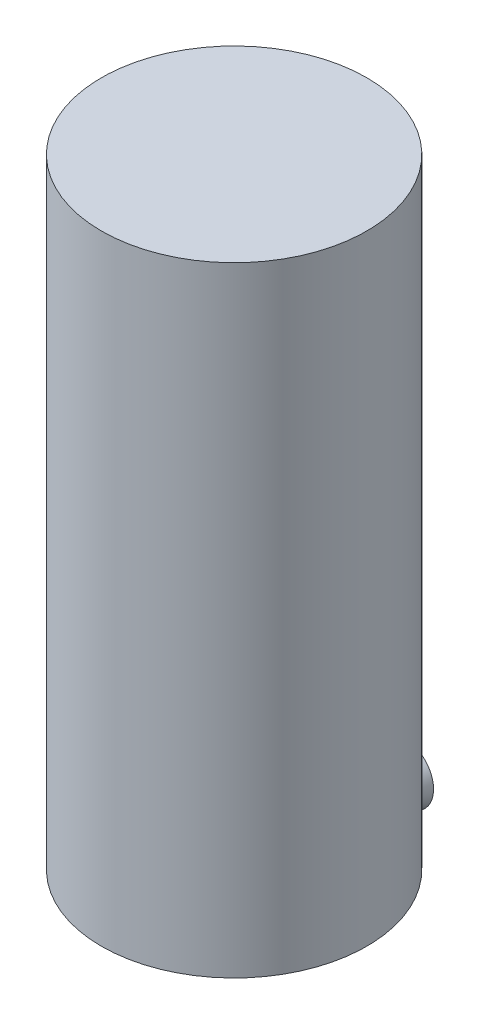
ISO-10303-21;
HEADER;
FILE_DESCRIPTION(('STEP AP214'),'2;1');
FILE_NAME('part.step','',(''),(''),'','','');
FILE_SCHEMA(('AUTOMOTIVE_DESIGN { 1 0 10303 214 1 1 1 1 }'));
ENDSEC;
DATA;
#1=APPLICATION_CONTEXT('core data for automotive mechanical design processes');
#2=APPLICATION_PROTOCOL_DEFINITION('international standard','automotive_design',2000,#1);
#3=PRODUCT_CONTEXT('',#1,'mechanical');
#4=PRODUCT('Part','Part','',(#3));
#5=PRODUCT_RELATED_PRODUCT_CATEGORY('part','',(#4));
#6=PRODUCT_DEFINITION_FORMATION('','',#4);
#7=PRODUCT_DEFINITION_CONTEXT('part definition',#1,'design');
#8=PRODUCT_DEFINITION('design','',#6,#7);
#9=PRODUCT_DEFINITION_SHAPE('','',#8);
#10=(LENGTH_UNIT() NAMED_UNIT(*) SI_UNIT(.MILLI.,.METRE.));
#11=(NAMED_UNIT(*) PLANE_ANGLE_UNIT() SI_UNIT($,.RADIAN.));
#12=(NAMED_UNIT(*) SI_UNIT($,.STERADIAN.) SOLID_ANGLE_UNIT());
#13=UNCERTAINTY_MEASURE_WITH_UNIT(LENGTH_MEASURE(1.E-05),#10,'distance_accuracy_value','');
#14=(GEOMETRIC_REPRESENTATION_CONTEXT(3) GLOBAL_UNCERTAINTY_ASSIGNED_CONTEXT((#13)) GLOBAL_UNIT_ASSIGNED_CONTEXT((#10,
#11,#12)) REPRESENTATION_CONTEXT('',''));
#15=CARTESIAN_POINT('',(0.,0.,0.));
#16=DIRECTION('',(0.,0.,1.));
#17=DIRECTION('',(1.,0.,0.));
#18=AXIS2_PLACEMENT_3D('',#15,#16,#17);
#19=CARTESIAN_POINT('',(0.,0.,-48.6210250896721));
#20=DIRECTION('',(0.,0.,1.));
#21=DIRECTION('',(0.,-1.,0.));
#22=AXIS2_PLACEMENT_3D('',#19,#20,#21);
#23=PLANE('',#22);
#24=CARTESIAN_POINT('',(0.,0.,-48.6210250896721));
#25=DIRECTION('',(0.,0.,1.));
#26=DIRECTION('',(0.,-1.,0.));
#27=AXIS2_PLACEMENT_3D('',#24,#25,#26);
#28=CIRCLE('',#27,8.62781121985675);
#29=CARTESIAN_POINT('',(0.,-8.62781121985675,-48.6210250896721));
#30=VERTEX_POINT('',#29);
#31=EDGE_CURVE('E11',#30,#30,#28,.T.);
#32=ORIENTED_EDGE('',*,*,#31,.F.);
#33=EDGE_LOOP('',(#32));
#34=FACE_BOUND('',#33,.T.);
#35=ADVANCED_FACE('F37',(#34),#23,.F.);
#36=CARTESIAN_POINT('',(0.,0.,-48.6210250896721));
#37=DIRECTION('',(0.,0.,-1.));
#38=DIRECTION('',(0.,1.,0.));
#39=AXIS2_PLACEMENT_3D('',#36,#37,#38);
#40=CONICAL_SURFACE('',#39,8.62781121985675,0.340730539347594);
#41=CARTESIAN_POINT('',(0.,0.,-37.4432196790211));
#42=DIRECTION('',(0.,0.,1.));
#43=DIRECTION('',(0.,-1.,0.));
#44=AXIS2_PLACEMENT_3D('',#41,#42,#43);
#45=CIRCLE('',#44,4.66461923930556);
#46=CARTESIAN_POINT('',(0.,-4.66461923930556,-37.4432196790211));
#47=VERTEX_POINT('',#46);
#48=EDGE_CURVE('E43',#47,#47,#45,.T.);
#49=ORIENTED_EDGE('',*,*,#48,.F.);
#50=EDGE_LOOP('',(#49));
#51=FACE_BOUND('',#50,.T.);
#52=ORIENTED_EDGE('',*,*,#31,.T.);
#53=EDGE_LOOP('',(#52));
#54=FACE_BOUND('',#53,.T.);
#55=ADVANCED_FACE('F51',(#51,#54),#40,.T.);
#56=CARTESIAN_POINT('',(0.,0.,-39.0971026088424));
#57=DIRECTION('',(0.,0.,1.));
#58=DIRECTION('',(0.,1.,0.));
#59=AXIS2_PLACEMENT_3D('',#56,#57,#58);
#60=SPHERICAL_SURFACE('',#59,4.94914148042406);
#61=ORIENTED_EDGE('',*,*,#48,.T.);
#62=EDGE_LOOP('',(#61));
#63=FACE_BOUND('',#62,.T.);
#64=ADVANCED_FACE('F49',(#63),#60,.T.);
#65=CLOSED_SHELL('',(#35,#55,#64));
#66=MANIFOLD_SOLID_BREP('B2',#65);
#67=CARTESIAN_POINT('',(0.,177.8,0.));
#68=DIRECTION('',(0.,-1.,0.));
#69=DIRECTION('',(0.,0.,-1.));
#70=AXIS2_PLACEMENT_3D('',#67,#68,#69);
#71=CYLINDRICAL_SURFACE('',#70,38.1);
#72=CARTESIAN_POINT('',(0.,177.8,0.));
#73=DIRECTION('',(0.,1.,0.));
#74=DIRECTION('',(0.,0.,1.));
#75=AXIS2_PLACEMENT_3D('',#72,#73,#74);
#76=CIRCLE('',#75,38.1);
#77=CARTESIAN_POINT('',(0.,177.8,38.1));
#78=VERTEX_POINT('',#77);
#79=EDGE_CURVE('E36',#78,#78,#76,.T.);
#80=ORIENTED_EDGE('',*,*,#79,.F.);
#81=EDGE_LOOP('',(#80));
#82=FACE_BOUND('',#81,.T.);
#83=CARTESIAN_POINT('',(0.,0.,0.));
#84=DIRECTION('',(0.,1.,0.));
#85=DIRECTION('',(0.,0.,1.));
#86=AXIS2_PLACEMENT_3D('',#83,#84,#85);
#87=CIRCLE('',#86,38.1);
#88=CARTESIAN_POINT('',(0.,0.,38.1));
#89=VERTEX_POINT('',#88);
#90=EDGE_CURVE('E81',#89,#89,#87,.T.);
#91=ORIENTED_EDGE('',*,*,#90,.T.);
#92=EDGE_LOOP('',(#91));
#93=FACE_BOUND('',#92,.T.);
#94=ADVANCED_FACE('F78',(#82,#93),#71,.T.);
#95=CARTESIAN_POINT('',(0.,177.8,0.));
#96=DIRECTION('',(0.,1.,0.));
#97=DIRECTION('',(0.,0.,1.));
#98=AXIS2_PLACEMENT_3D('',#95,#96,#97);
#99=PLANE('',#98);
#100=ORIENTED_EDGE('',*,*,#79,.T.);
#101=EDGE_LOOP('',(#100));
#102=FACE_BOUND('',#101,.T.);
#103=ADVANCED_FACE('F93',(#102),#99,.T.);
#104=CARTESIAN_POINT('',(0.,0.,0.));
#105=DIRECTION('',(0.,1.,0.));
#106=DIRECTION('',(0.,0.,1.));
#107=AXIS2_PLACEMENT_3D('',#104,#105,#106);
#108=PLANE('',#107);
#109=ORIENTED_EDGE('',*,*,#90,.F.);
#110=EDGE_LOOP('',(#109));
#111=FACE_BOUND('',#110,.T.);
#112=ADVANCED_FACE('F91',(#111),#108,.F.);
#113=CLOSED_SHELL('',(#94,#103,#112));
#114=MANIFOLD_SOLID_BREP('B6',#113);
#115=ADVANCED_BREP_SHAPE_REPRESENTATION('',(#18,#66,#114),#14);
#116=SHAPE_DEFINITION_REPRESENTATION(#9,#115);
ENDSEC;
END-ISO-10303-21;
